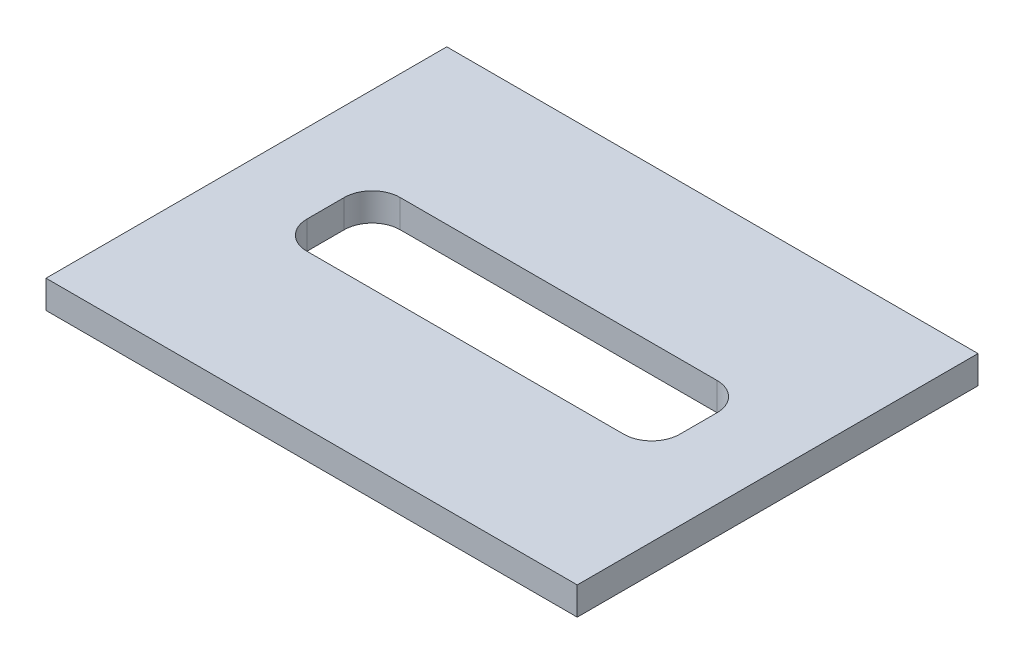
ISO-10303-21;
HEADER;
FILE_DESCRIPTION(('STEP AP214'),'2;1');
FILE_NAME('part.step','',(''),(''),'','','');
FILE_SCHEMA(('AUTOMOTIVE_DESIGN { 1 0 10303 214 1 1 1 1 }'));
ENDSEC;
DATA;
#1=APPLICATION_CONTEXT('core data for automotive mechanical design processes');
#2=APPLICATION_PROTOCOL_DEFINITION('international standard','automotive_design',2000,#1);
#3=PRODUCT_CONTEXT('',#1,'mechanical');
#4=PRODUCT('Part','Part','',(#3));
#5=PRODUCT_RELATED_PRODUCT_CATEGORY('part','',(#4));
#6=PRODUCT_DEFINITION_FORMATION('','',#4);
#7=PRODUCT_DEFINITION_CONTEXT('part definition',#1,'design');
#8=PRODUCT_DEFINITION('design','',#6,#7);
#9=PRODUCT_DEFINITION_SHAPE('','',#8);
#10=(LENGTH_UNIT() NAMED_UNIT(*) SI_UNIT(.MILLI.,.METRE.));
#11=(NAMED_UNIT(*) PLANE_ANGLE_UNIT() SI_UNIT($,.RADIAN.));
#12=(NAMED_UNIT(*) SI_UNIT($,.STERADIAN.) SOLID_ANGLE_UNIT());
#13=UNCERTAINTY_MEASURE_WITH_UNIT(LENGTH_MEASURE(1.E-05),#10,'distance_accuracy_value','');
#14=(GEOMETRIC_REPRESENTATION_CONTEXT(3) GLOBAL_UNCERTAINTY_ASSIGNED_CONTEXT((#13)) GLOBAL_UNIT_ASSIGNED_CONTEXT((#10,
#11,#12)) REPRESENTATION_CONTEXT('',''));
#15=CARTESIAN_POINT('',(0.,0.,0.));
#16=DIRECTION('',(0.,0.,1.));
#17=DIRECTION('',(1.,0.,0.));
#18=AXIS2_PLACEMENT_3D('',#15,#16,#17);
#19=CARTESIAN_POINT('',(28.5,3.,21.5));
#20=DIRECTION('',(-1.,0.,0.));
#21=DIRECTION('',(0.,0.,1.));
#22=AXIS2_PLACEMENT_3D('',#19,#20,#21);
#23=PLANE('',#22);
#24=DIRECTION('',(0.,0.,-1.));
#25=VECTOR('',#24,1.);
#26=CARTESIAN_POINT('',(28.5,0.,21.5));
#27=LINE('',#26,#25);
#28=CARTESIAN_POINT('',(28.5,0.,21.5));
#29=VERTEX_POINT('',#28);
#30=CARTESIAN_POINT('',(28.5,0.,-21.5));
#31=VERTEX_POINT('',#30);
#32=EDGE_CURVE('E143',#29,#31,#27,.T.);
#33=ORIENTED_EDGE('',*,*,#32,.T.);
#34=DIRECTION('',(0.,-1.,0.));
#35=VECTOR('',#34,1.);
#36=CARTESIAN_POINT('',(28.5,3.,-21.5));
#37=LINE('',#36,#35);
#38=CARTESIAN_POINT('',(28.5,3.,-21.5));
#39=VERTEX_POINT('',#38);
#40=EDGE_CURVE('E124',#39,#31,#37,.T.);
#41=ORIENTED_EDGE('',*,*,#40,.F.);
#42=DIRECTION('',(0.,0.,-1.));
#43=VECTOR('',#42,1.);
#44=CARTESIAN_POINT('',(28.5,3.,21.5));
#45=LINE('',#44,#43);
#46=CARTESIAN_POINT('',(28.5,3.,21.5));
#47=VERTEX_POINT('',#46);
#48=EDGE_CURVE('E131',#47,#39,#45,.T.);
#49=ORIENTED_EDGE('',*,*,#48,.F.);
#50=DIRECTION('',(0.,-1.,0.));
#51=VECTOR('',#50,1.);
#52=CARTESIAN_POINT('',(28.5,3.,21.5));
#53=LINE('',#52,#51);
#54=EDGE_CURVE('E254',#47,#29,#53,.T.);
#55=ORIENTED_EDGE('',*,*,#54,.T.);
#56=EDGE_LOOP('',(#33,#41,#49,#55));
#57=FACE_BOUND('',#56,.T.);
#58=ADVANCED_FACE('F31',(#57),#23,.F.);
#59=CARTESIAN_POINT('',(-28.5,3.,-21.5));
#60=DIRECTION('',(0.,0.,1.));
#61=DIRECTION('',(1.,0.,0.));
#62=AXIS2_PLACEMENT_3D('',#59,#60,#61);
#63=PLANE('',#62);
#64=DIRECTION('',(-1.,0.,0.));
#65=VECTOR('',#64,1.);
#66=CARTESIAN_POINT('',(-28.5,0.,-21.5));
#67=LINE('',#66,#65);
#68=CARTESIAN_POINT('',(-28.5,0.,-21.5));
#69=VERTEX_POINT('',#68);
#70=EDGE_CURVE('E256',#31,#69,#67,.T.);
#71=ORIENTED_EDGE('',*,*,#70,.T.);
#72=DIRECTION('',(0.,-1.,0.));
#73=VECTOR('',#72,1.);
#74=CARTESIAN_POINT('',(-28.5,3.,-21.5));
#75=LINE('',#74,#73);
#76=CARTESIAN_POINT('',(-28.5,3.,-21.5));
#77=VERTEX_POINT('',#76);
#78=EDGE_CURVE('E127',#77,#69,#75,.T.);
#79=ORIENTED_EDGE('',*,*,#78,.F.);
#80=DIRECTION('',(-1.,0.,0.));
#81=VECTOR('',#80,1.);
#82=CARTESIAN_POINT('',(-28.5,3.,-21.5));
#83=LINE('',#82,#81);
#84=EDGE_CURVE('E120',#39,#77,#83,.T.);
#85=ORIENTED_EDGE('',*,*,#84,.F.);
#86=ORIENTED_EDGE('',*,*,#40,.T.);
#87=EDGE_LOOP('',(#71,#79,#85,#86));
#88=FACE_BOUND('',#87,.T.);
#89=ADVANCED_FACE('F122',(#88),#63,.F.);
#90=CARTESIAN_POINT('',(-28.5,3.,21.5));
#91=DIRECTION('',(1.,0.,0.));
#92=DIRECTION('',(0.,0.,-1.));
#93=AXIS2_PLACEMENT_3D('',#90,#91,#92);
#94=PLANE('',#93);
#95=DIRECTION('',(0.,0.,1.));
#96=VECTOR('',#95,1.);
#97=CARTESIAN_POINT('',(-28.5,0.,21.5));
#98=LINE('',#97,#96);
#99=CARTESIAN_POINT('',(-28.5,0.,21.5));
#100=VERTEX_POINT('',#99);
#101=EDGE_CURVE('E258',#69,#100,#98,.T.);
#102=ORIENTED_EDGE('',*,*,#101,.T.);
#103=DIRECTION('',(0.,-1.,0.));
#104=VECTOR('',#103,1.);
#105=CARTESIAN_POINT('',(-28.5,3.,21.5));
#106=LINE('',#105,#104);
#107=CARTESIAN_POINT('',(-28.5,3.,21.5));
#108=VERTEX_POINT('',#107);
#109=EDGE_CURVE('E149',#108,#100,#106,.T.);
#110=ORIENTED_EDGE('',*,*,#109,.F.);
#111=DIRECTION('',(0.,0.,1.));
#112=VECTOR('',#111,1.);
#113=CARTESIAN_POINT('',(-28.5,3.,21.5));
#114=LINE('',#113,#112);
#115=EDGE_CURVE('E130',#77,#108,#114,.T.);
#116=ORIENTED_EDGE('',*,*,#115,.F.);
#117=ORIENTED_EDGE('',*,*,#78,.T.);
#118=EDGE_LOOP('',(#102,#110,#116,#117));
#119=FACE_BOUND('',#118,.T.);
#120=ADVANCED_FACE('F217',(#119),#94,.F.);
#121=CARTESIAN_POINT('',(-28.5,3.,21.5));
#122=DIRECTION('',(0.,0.,-1.));
#123=DIRECTION('',(-1.,0.,0.));
#124=AXIS2_PLACEMENT_3D('',#121,#122,#123);
#125=PLANE('',#124);
#126=DIRECTION('',(1.,0.,0.));
#127=VECTOR('',#126,1.);
#128=CARTESIAN_POINT('',(-28.5,0.,21.5));
#129=LINE('',#128,#127);
#130=EDGE_CURVE('E140',#100,#29,#129,.T.);
#131=ORIENTED_EDGE('',*,*,#130,.T.);
#132=ORIENTED_EDGE('',*,*,#54,.F.);
#133=DIRECTION('',(1.,0.,0.));
#134=VECTOR('',#133,1.);
#135=CARTESIAN_POINT('',(-28.5,3.,21.5));
#136=LINE('',#135,#134);
#137=EDGE_CURVE('E136',#108,#47,#136,.T.);
#138=ORIENTED_EDGE('',*,*,#137,.F.);
#139=ORIENTED_EDGE('',*,*,#109,.T.);
#140=EDGE_LOOP('',(#131,#132,#138,#139));
#141=FACE_BOUND('',#140,.T.);
#142=ADVANCED_FACE('F265',(#141),#125,.F.);
#143=CARTESIAN_POINT('',(28.5,3.,-21.5));
#144=DIRECTION('',(0.,-1.,0.));
#145=DIRECTION('',(0.,0.,-1.));
#146=AXIS2_PLACEMENT_3D('',#143,#144,#145);
#147=PLANE('',#146);
#148=DIRECTION('',(-1.,0.,0.));
#149=VECTOR('',#148,1.);
#150=CARTESIAN_POINT('',(-20.,3.,-5.));
#151=LINE('',#150,#149);
#152=CARTESIAN_POINT('',(17.,3.,-5.));
#153=VERTEX_POINT('',#152);
#154=CARTESIAN_POINT('',(-17.,3.,-5.));
#155=VERTEX_POINT('',#154);
#156=EDGE_CURVE('E243',#153,#155,#151,.T.);
#157=ORIENTED_EDGE('',*,*,#156,.F.);
#158=CARTESIAN_POINT('',(17.,3.,-2.));
#159=DIRECTION('',(0.,-1.,0.));
#160=DIRECTION('',(0.,0.,-1.));
#161=AXIS2_PLACEMENT_3D('',#158,#159,#160);
#162=CIRCLE('',#161,3.);
#163=CARTESIAN_POINT('',(20.,3.,-2.));
#164=VERTEX_POINT('',#163);
#165=EDGE_CURVE('E184',#153,#164,#162,.T.);
#166=ORIENTED_EDGE('',*,*,#165,.T.);
#167=DIRECTION('',(0.,0.,-1.));
#168=VECTOR('',#167,1.);
#169=CARTESIAN_POINT('',(20.,3.,5.));
#170=LINE('',#169,#168);
#171=CARTESIAN_POINT('',(20.,3.,2.));
#172=VERTEX_POINT('',#171);
#173=EDGE_CURVE('E239',#172,#164,#170,.T.);
#174=ORIENTED_EDGE('',*,*,#173,.F.);
#175=CARTESIAN_POINT('',(17.,3.,2.));
#176=DIRECTION('',(0.,-1.,0.));
#177=DIRECTION('',(0.,0.,-1.));
#178=AXIS2_PLACEMENT_3D('',#175,#176,#177);
#179=CIRCLE('',#178,3.);
#180=CARTESIAN_POINT('',(17.,3.,5.));
#181=VERTEX_POINT('',#180);
#182=EDGE_CURVE('E180',#172,#181,#179,.T.);
#183=ORIENTED_EDGE('',*,*,#182,.T.);
#184=DIRECTION('',(1.,0.,0.));
#185=VECTOR('',#184,1.);
#186=CARTESIAN_POINT('',(-20.,3.,5.));
#187=LINE('',#186,#185);
#188=CARTESIAN_POINT('',(-17.,3.,5.));
#189=VERTEX_POINT('',#188);
#190=EDGE_CURVE('E246',#189,#181,#187,.T.);
#191=ORIENTED_EDGE('',*,*,#190,.F.);
#192=CARTESIAN_POINT('',(-17.,3.,2.));
#193=DIRECTION('',(0.,-1.,0.));
#194=DIRECTION('',(0.,0.,-1.));
#195=AXIS2_PLACEMENT_3D('',#192,#193,#194);
#196=CIRCLE('',#195,3.);
#197=CARTESIAN_POINT('',(-20.,3.,2.));
#198=VERTEX_POINT('',#197);
#199=EDGE_CURVE('E39',#189,#198,#196,.T.);
#200=ORIENTED_EDGE('',*,*,#199,.T.);
#201=DIRECTION('',(0.,0.,1.));
#202=VECTOR('',#201,1.);
#203=CARTESIAN_POINT('',(-20.,3.,5.));
#204=LINE('',#203,#202);
#205=CARTESIAN_POINT('',(-20.,3.,-2.));
#206=VERTEX_POINT('',#205);
#207=EDGE_CURVE('E244',#206,#198,#204,.T.);
#208=ORIENTED_EDGE('',*,*,#207,.F.);
#209=CARTESIAN_POINT('',(-17.,3.,-2.));
#210=DIRECTION('',(0.,-1.,0.));
#211=DIRECTION('',(0.,0.,-1.));
#212=AXIS2_PLACEMENT_3D('',#209,#210,#211);
#213=CIRCLE('',#212,3.);
#214=EDGE_CURVE('E53',#206,#155,#213,.T.);
#215=ORIENTED_EDGE('',*,*,#214,.T.);
#216=EDGE_LOOP('',(#157,#166,#174,#183,#191,#200,#208,#215));
#217=FACE_BOUND('',#216,.T.);
#218=ORIENTED_EDGE('',*,*,#48,.T.);
#219=ORIENTED_EDGE('',*,*,#84,.T.);
#220=ORIENTED_EDGE('',*,*,#115,.T.);
#221=ORIENTED_EDGE('',*,*,#137,.T.);
#222=EDGE_LOOP('',(#218,#219,#220,#221));
#223=FACE_BOUND('',#222,.T.);
#224=ADVANCED_FACE('F134',(#217,#223),#147,.F.);
#225=CARTESIAN_POINT('',(28.5,0.,-21.5));
#226=DIRECTION('',(0.,-1.,0.));
#227=DIRECTION('',(0.,0.,-1.));
#228=AXIS2_PLACEMENT_3D('',#225,#226,#227);
#229=PLANE('',#228);
#230=DIRECTION('',(0.,0.,1.));
#231=VECTOR('',#230,1.);
#232=CARTESIAN_POINT('',(20.,0.,-21.5));
#233=LINE('',#232,#231);
#234=CARTESIAN_POINT('',(20.,0.,-2.));
#235=VERTEX_POINT('',#234);
#236=CARTESIAN_POINT('',(20.,0.,2.));
#237=VERTEX_POINT('',#236);
#238=EDGE_CURVE('E158',#235,#237,#233,.T.);
#239=ORIENTED_EDGE('',*,*,#238,.F.);
#240=CARTESIAN_POINT('',(17.,0.,-2.));
#241=DIRECTION('',(0.,-1.,0.));
#242=DIRECTION('',(0.,0.,-1.));
#243=AXIS2_PLACEMENT_3D('',#240,#241,#242);
#244=CIRCLE('',#243,3.);
#245=CARTESIAN_POINT('',(17.,0.,-5.));
#246=VERTEX_POINT('',#245);
#247=EDGE_CURVE('E186',#235,#246,#244,.F.);
#248=ORIENTED_EDGE('',*,*,#247,.T.);
#249=DIRECTION('',(1.,0.,0.));
#250=VECTOR('',#249,1.);
#251=CARTESIAN_POINT('',(28.5,0.,-5.));
#252=LINE('',#251,#250);
#253=CARTESIAN_POINT('',(-17.,0.,-5.));
#254=VERTEX_POINT('',#253);
#255=EDGE_CURVE('E144',#254,#246,#252,.T.);
#256=ORIENTED_EDGE('',*,*,#255,.F.);
#257=CARTESIAN_POINT('',(-17.,0.,-2.));
#258=DIRECTION('',(0.,-1.,0.));
#259=DIRECTION('',(0.,0.,-1.));
#260=AXIS2_PLACEMENT_3D('',#257,#258,#259);
#261=CIRCLE('',#260,3.);
#262=CARTESIAN_POINT('',(-20.,0.,-2.));
#263=VERTEX_POINT('',#262);
#264=EDGE_CURVE('E189',#254,#263,#261,.F.);
#265=ORIENTED_EDGE('',*,*,#264,.T.);
#266=DIRECTION('',(0.,0.,-1.));
#267=VECTOR('',#266,1.);
#268=CARTESIAN_POINT('',(-20.,0.,-21.5));
#269=LINE('',#268,#267);
#270=CARTESIAN_POINT('',(-20.,0.,2.));
#271=VERTEX_POINT('',#270);
#272=EDGE_CURVE('E147',#271,#263,#269,.T.);
#273=ORIENTED_EDGE('',*,*,#272,.F.);
#274=CARTESIAN_POINT('',(-17.,0.,2.));
#275=DIRECTION('',(0.,-1.,0.));
#276=DIRECTION('',(0.,0.,-1.));
#277=AXIS2_PLACEMENT_3D('',#274,#275,#276);
#278=CIRCLE('',#277,3.);
#279=CARTESIAN_POINT('',(-17.,0.,5.));
#280=VERTEX_POINT('',#279);
#281=EDGE_CURVE('E11',#271,#280,#278,.F.);
#282=ORIENTED_EDGE('',*,*,#281,.T.);
#283=DIRECTION('',(-1.,0.,0.));
#284=VECTOR('',#283,1.);
#285=CARTESIAN_POINT('',(28.5,0.,5.));
#286=LINE('',#285,#284);
#287=CARTESIAN_POINT('',(17.,0.,5.));
#288=VERTEX_POINT('',#287);
#289=EDGE_CURVE('E155',#288,#280,#286,.T.);
#290=ORIENTED_EDGE('',*,*,#289,.F.);
#291=CARTESIAN_POINT('',(17.,0.,2.));
#292=DIRECTION('',(0.,-1.,0.));
#293=DIRECTION('',(0.,0.,-1.));
#294=AXIS2_PLACEMENT_3D('',#291,#292,#293);
#295=CIRCLE('',#294,3.);
#296=EDGE_CURVE('E182',#288,#237,#295,.F.);
#297=ORIENTED_EDGE('',*,*,#296,.T.);
#298=EDGE_LOOP('',(#239,#248,#256,#265,#273,#282,#290,#297));
#299=FACE_BOUND('',#298,.T.);
#300=ORIENTED_EDGE('',*,*,#32,.F.);
#301=ORIENTED_EDGE('',*,*,#130,.F.);
#302=ORIENTED_EDGE('',*,*,#101,.F.);
#303=ORIENTED_EDGE('',*,*,#70,.F.);
#304=EDGE_LOOP('',(#300,#301,#302,#303));
#305=FACE_BOUND('',#304,.T.);
#306=ADVANCED_FACE('F195',(#299,#305),#229,.T.);
#307=CARTESIAN_POINT('',(20.,-7.,5.));
#308=DIRECTION('',(1.,0.,0.));
#309=DIRECTION('',(0.,0.,-1.));
#310=AXIS2_PLACEMENT_3D('',#307,#308,#309);
#311=PLANE('',#310);
#312=ORIENTED_EDGE('',*,*,#238,.T.);
#313=DIRECTION('',(0.,1.,0.));
#314=VECTOR('',#313,1.);
#315=CARTESIAN_POINT('',(20.,3.,2.));
#316=LINE('',#315,#314);
#317=EDGE_CURVE('E163',#237,#172,#316,.T.);
#318=ORIENTED_EDGE('',*,*,#317,.T.);
#319=ORIENTED_EDGE('',*,*,#173,.T.);
#320=DIRECTION('',(0.,1.,0.));
#321=VECTOR('',#320,1.);
#322=CARTESIAN_POINT('',(20.,0.,-2.));
#323=LINE('',#322,#321);
#324=EDGE_CURVE('E161',#164,#235,#323,.F.);
#325=ORIENTED_EDGE('',*,*,#324,.T.);
#326=EDGE_LOOP('',(#312,#318,#319,#325));
#327=FACE_BOUND('',#326,.T.);
#328=ADVANCED_FACE('F235',(#327),#311,.F.);
#329=CARTESIAN_POINT('',(-20.,-7.,5.));
#330=DIRECTION('',(0.,0.,1.));
#331=DIRECTION('',(1.,0.,0.));
#332=AXIS2_PLACEMENT_3D('',#329,#330,#331);
#333=PLANE('',#332);
#334=ORIENTED_EDGE('',*,*,#190,.T.);
#335=DIRECTION('',(0.,1.,0.));
#336=VECTOR('',#335,1.);
#337=CARTESIAN_POINT('',(17.,0.,5.));
#338=LINE('',#337,#336);
#339=EDGE_CURVE('E169',#181,#288,#338,.F.);
#340=ORIENTED_EDGE('',*,*,#339,.T.);
#341=ORIENTED_EDGE('',*,*,#289,.T.);
#342=DIRECTION('',(0.,1.,0.));
#343=VECTOR('',#342,1.);
#344=CARTESIAN_POINT('',(-17.,3.,5.));
#345=LINE('',#344,#343);
#346=EDGE_CURVE('E166',#280,#189,#345,.T.);
#347=ORIENTED_EDGE('',*,*,#346,.T.);
#348=EDGE_LOOP('',(#334,#340,#341,#347));
#349=FACE_BOUND('',#348,.T.);
#350=ADVANCED_FACE('F279',(#349),#333,.F.);
#351=CARTESIAN_POINT('',(-20.,-7.,5.));
#352=DIRECTION('',(-1.,0.,0.));
#353=DIRECTION('',(0.,0.,1.));
#354=AXIS2_PLACEMENT_3D('',#351,#352,#353);
#355=PLANE('',#354);
#356=ORIENTED_EDGE('',*,*,#272,.T.);
#357=DIRECTION('',(0.,1.,0.));
#358=VECTOR('',#357,1.);
#359=CARTESIAN_POINT('',(-20.,3.,-2.));
#360=LINE('',#359,#358);
#361=EDGE_CURVE('E178',#263,#206,#360,.T.);
#362=ORIENTED_EDGE('',*,*,#361,.T.);
#363=ORIENTED_EDGE('',*,*,#207,.T.);
#364=DIRECTION('',(0.,1.,0.));
#365=VECTOR('',#364,1.);
#366=CARTESIAN_POINT('',(-20.,0.,2.));
#367=LINE('',#366,#365);
#368=EDGE_CURVE('E176',#198,#271,#367,.F.);
#369=ORIENTED_EDGE('',*,*,#368,.T.);
#370=EDGE_LOOP('',(#356,#362,#363,#369));
#371=FACE_BOUND('',#370,.T.);
#372=ADVANCED_FACE('F199',(#371),#355,.F.);
#373=CARTESIAN_POINT('',(-20.,-7.,-5.));
#374=DIRECTION('',(0.,0.,-1.));
#375=DIRECTION('',(-1.,0.,0.));
#376=AXIS2_PLACEMENT_3D('',#373,#374,#375);
#377=PLANE('',#376);
#378=ORIENTED_EDGE('',*,*,#255,.T.);
#379=DIRECTION('',(0.,1.,0.));
#380=VECTOR('',#379,1.);
#381=CARTESIAN_POINT('',(17.,3.,-5.));
#382=LINE('',#381,#380);
#383=EDGE_CURVE('E173',#246,#153,#382,.T.);
#384=ORIENTED_EDGE('',*,*,#383,.T.);
#385=ORIENTED_EDGE('',*,*,#156,.T.);
#386=DIRECTION('',(0.,1.,0.));
#387=VECTOR('',#386,1.);
#388=CARTESIAN_POINT('',(-17.,0.,-5.));
#389=LINE('',#388,#387);
#390=EDGE_CURVE('E171',#155,#254,#389,.F.);
#391=ORIENTED_EDGE('',*,*,#390,.T.);
#392=EDGE_LOOP('',(#378,#384,#385,#391));
#393=FACE_BOUND('',#392,.T.);
#394=ADVANCED_FACE('F222',(#393),#377,.F.);
#395=CARTESIAN_POINT('',(17.,-7.,2.));
#396=DIRECTION('',(0.,-1.,0.));
#397=DIRECTION('',(0.,0.,-1.));
#398=AXIS2_PLACEMENT_3D('',#395,#396,#397);
#399=CYLINDRICAL_SURFACE('',#398,3.);
#400=ORIENTED_EDGE('',*,*,#296,.F.);
#401=ORIENTED_EDGE('',*,*,#339,.F.);
#402=ORIENTED_EDGE('',*,*,#182,.F.);
#403=ORIENTED_EDGE('',*,*,#317,.F.);
#404=EDGE_LOOP('',(#400,#401,#402,#403));
#405=FACE_BOUND('',#404,.T.);
#406=ADVANCED_FACE('F209',(#405),#399,.F.);
#407=CARTESIAN_POINT('',(17.,-7.,-2.));
#408=DIRECTION('',(0.,-1.,0.));
#409=DIRECTION('',(0.,0.,-1.));
#410=AXIS2_PLACEMENT_3D('',#407,#408,#409);
#411=CYLINDRICAL_SURFACE('',#410,3.);
#412=ORIENTED_EDGE('',*,*,#247,.F.);
#413=ORIENTED_EDGE('',*,*,#324,.F.);
#414=ORIENTED_EDGE('',*,*,#165,.F.);
#415=ORIENTED_EDGE('',*,*,#383,.F.);
#416=EDGE_LOOP('',(#412,#413,#414,#415));
#417=FACE_BOUND('',#416,.T.);
#418=ADVANCED_FACE('F203',(#417),#411,.F.);
#419=CARTESIAN_POINT('',(-17.,-7.,-2.));
#420=DIRECTION('',(0.,-1.,0.));
#421=DIRECTION('',(0.,0.,-1.));
#422=AXIS2_PLACEMENT_3D('',#419,#420,#421);
#423=CYLINDRICAL_SURFACE('',#422,3.);
#424=ORIENTED_EDGE('',*,*,#264,.F.);
#425=ORIENTED_EDGE('',*,*,#390,.F.);
#426=ORIENTED_EDGE('',*,*,#214,.F.);
#427=ORIENTED_EDGE('',*,*,#361,.F.);
#428=EDGE_LOOP('',(#424,#425,#426,#427));
#429=FACE_BOUND('',#428,.T.);
#430=ADVANCED_FACE('F201',(#429),#423,.F.);
#431=CARTESIAN_POINT('',(-17.,-7.,2.));
#432=DIRECTION('',(0.,-1.,0.));
#433=DIRECTION('',(0.,0.,-1.));
#434=AXIS2_PLACEMENT_3D('',#431,#432,#433);
#435=CYLINDRICAL_SURFACE('',#434,3.);
#436=ORIENTED_EDGE('',*,*,#281,.F.);
#437=ORIENTED_EDGE('',*,*,#368,.F.);
#438=ORIENTED_EDGE('',*,*,#199,.F.);
#439=ORIENTED_EDGE('',*,*,#346,.F.);
#440=EDGE_LOOP('',(#436,#437,#438,#439));
#441=FACE_BOUND('',#440,.T.);
#442=ADVANCED_FACE('F33',(#441),#435,.F.);
#443=CLOSED_SHELL('',(#58,#89,#120,#142,#224,#306,#328,#350,#372,#394,#406,#418,#430,#442));
#444=MANIFOLD_SOLID_BREP('B2',#443);
#445=ADVANCED_BREP_SHAPE_REPRESENTATION('',(#18,#444),#14);
#446=SHAPE_DEFINITION_REPRESENTATION(#9,#445);
ENDSEC;
END-ISO-10303-21;
